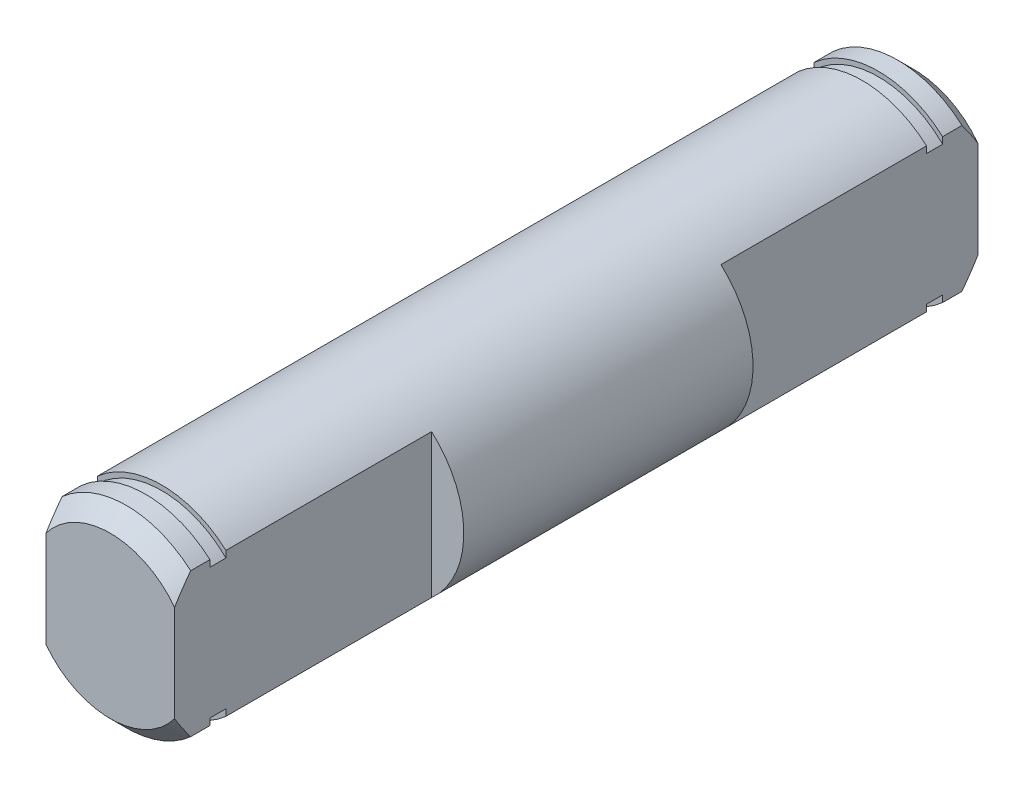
ISO-10303-21;
HEADER;
FILE_DESCRIPTION(('STEP AP214'),'2;1');
FILE_NAME('part.step','',(''),(''),'','','');
FILE_SCHEMA(('AUTOMOTIVE_DESIGN { 1 0 10303 214 1 1 1 1 }'));
ENDSEC;
DATA;
#1=APPLICATION_CONTEXT('core data for automotive mechanical design processes');
#2=APPLICATION_PROTOCOL_DEFINITION('international standard','automotive_design',2000,#1);
#3=PRODUCT_CONTEXT('',#1,'mechanical');
#4=PRODUCT('Part','Part','',(#3));
#5=PRODUCT_RELATED_PRODUCT_CATEGORY('part','',(#4));
#6=PRODUCT_DEFINITION_FORMATION('','',#4);
#7=PRODUCT_DEFINITION_CONTEXT('part definition',#1,'design');
#8=PRODUCT_DEFINITION('design','',#6,#7);
#9=PRODUCT_DEFINITION_SHAPE('','',#8);
#10=(LENGTH_UNIT() NAMED_UNIT(*) SI_UNIT(.MILLI.,.METRE.));
#11=(NAMED_UNIT(*) PLANE_ANGLE_UNIT() SI_UNIT($,.RADIAN.));
#12=(NAMED_UNIT(*) SI_UNIT($,.STERADIAN.) SOLID_ANGLE_UNIT());
#13=UNCERTAINTY_MEASURE_WITH_UNIT(LENGTH_MEASURE(1.E-05),#10,'distance_accuracy_value','');
#14=(GEOMETRIC_REPRESENTATION_CONTEXT(3) GLOBAL_UNCERTAINTY_ASSIGNED_CONTEXT((#13)) GLOBAL_UNIT_ASSIGNED_CONTEXT((#10,
#11,#12)) REPRESENTATION_CONTEXT('',''));
#15=CARTESIAN_POINT('',(0.,0.,0.));
#16=DIRECTION('',(0.,0.,1.));
#17=DIRECTION('',(1.,0.,0.));
#18=AXIS2_PLACEMENT_3D('',#15,#16,#17);
#19=CARTESIAN_POINT('',(0.,0.,12.5));
#20=DIRECTION('',(0.,0.,-1.));
#21=DIRECTION('',(-1.,0.,0.));
#22=AXIS2_PLACEMENT_3D('',#19,#20,#21);
#23=CYLINDRICAL_SURFACE('',#22,3.);
#24=DIRECTION('',(0.,0.,-1.));
#25=VECTOR('',#24,1.);
#26=CARTESIAN_POINT('',(-2.,2.23606797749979,12.5));
#27=LINE('',#26,#25);
#28=CARTESIAN_POINT('',(-2.,2.23606797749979,12.));
#29=VERTEX_POINT('',#28);
#30=CARTESIAN_POINT('',(-2.,2.23606797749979,11.4));
#31=VERTEX_POINT('',#30);
#32=EDGE_CURVE('E424',#29,#31,#27,.T.);
#33=ORIENTED_EDGE('',*,*,#32,.F.);
#34=CARTESIAN_POINT('',(0.,0.,12.));
#35=DIRECTION('',(0.,0.,1.));
#36=DIRECTION('',(1.,0.,0.));
#37=AXIS2_PLACEMENT_3D('',#34,#35,#36);
#38=CIRCLE('',#37,3.);
#39=CARTESIAN_POINT('',(2.,2.23606797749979,12.));
#40=VERTEX_POINT('',#39);
#41=EDGE_CURVE('E438',#29,#40,#38,.F.);
#42=ORIENTED_EDGE('',*,*,#41,.T.);
#43=DIRECTION('',(0.,0.,-1.));
#44=VECTOR('',#43,1.);
#45=CARTESIAN_POINT('',(2.,2.23606797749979,12.5));
#46=LINE('',#45,#44);
#47=CARTESIAN_POINT('',(2.,2.23606797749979,11.4));
#48=VERTEX_POINT('',#47);
#49=EDGE_CURVE('E383',#48,#40,#46,.F.);
#50=ORIENTED_EDGE('',*,*,#49,.F.);
#51=CARTESIAN_POINT('',(0.,0.,11.4));
#52=DIRECTION('',(0.,0.,-1.));
#53=DIRECTION('',(-1.,0.,0.));
#54=AXIS2_PLACEMENT_3D('',#51,#52,#53);
#55=CIRCLE('',#54,3.);
#56=EDGE_CURVE('E447',#31,#48,#55,.T.);
#57=ORIENTED_EDGE('',*,*,#56,.F.);
#58=EDGE_LOOP('',(#33,#42,#50,#57));
#59=FACE_BOUND('',#58,.T.);
#60=ADVANCED_FACE('F33',(#59),#23,.T.);
#61=DIRECTION('',(0.,0.,-1.));
#62=VECTOR('',#61,1.);
#63=CARTESIAN_POINT('',(-2.,-2.23606797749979,12.5));
#64=LINE('',#63,#62);
#65=CARTESIAN_POINT('',(-2.,-2.23606797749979,11.4));
#66=VERTEX_POINT('',#65);
#67=CARTESIAN_POINT('',(-2.,-2.23606797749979,12.));
#68=VERTEX_POINT('',#67);
#69=EDGE_CURVE('E417',#66,#68,#64,.F.);
#70=ORIENTED_EDGE('',*,*,#69,.F.);
#71=CARTESIAN_POINT('',(2.,-2.23606797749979,11.4));
#72=VERTEX_POINT('',#71);
#73=EDGE_CURVE('E446',#72,#66,#55,.T.);
#74=ORIENTED_EDGE('',*,*,#73,.F.);
#75=DIRECTION('',(0.,0.,-1.));
#76=VECTOR('',#75,1.);
#77=CARTESIAN_POINT('',(2.,-2.23606797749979,12.5));
#78=LINE('',#77,#76);
#79=CARTESIAN_POINT('',(2.,-2.23606797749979,12.));
#80=VERTEX_POINT('',#79);
#81=EDGE_CURVE('E474',#80,#72,#78,.T.);
#82=ORIENTED_EDGE('',*,*,#81,.F.);
#83=EDGE_CURVE('E440',#80,#68,#38,.F.);
#84=ORIENTED_EDGE('',*,*,#83,.T.);
#85=EDGE_LOOP('',(#70,#74,#82,#84));
#86=FACE_BOUND('',#85,.T.);
#87=ADVANCED_FACE('F321',(#86),#23,.T.);
#88=CARTESIAN_POINT('',(0.,0.,12.5));
#89=DIRECTION('',(0.,0.,1.));
#90=DIRECTION('',(1.,0.,0.));
#91=AXIS2_PLACEMENT_3D('',#88,#89,#90);
#92=PLANE('',#91);
#93=CARTESIAN_POINT('',(0.,0.,12.5));
#94=DIRECTION('',(0.,0.,1.));
#95=DIRECTION('',(1.,0.,0.));
#96=AXIS2_PLACEMENT_3D('',#93,#94,#95);
#97=CIRCLE('',#96,2.5);
#98=CARTESIAN_POINT('',(2.,1.5,12.5));
#99=VERTEX_POINT('',#98);
#100=CARTESIAN_POINT('',(-2.,1.5,12.5));
#101=VERTEX_POINT('',#100);
#102=EDGE_CURVE('E435',#99,#101,#97,.T.);
#103=ORIENTED_EDGE('',*,*,#102,.T.);
#104=DIRECTION('',(0.,-1.,0.));
#105=VECTOR('',#104,1.);
#106=CARTESIAN_POINT('',(-2.,3.30005546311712,12.5));
#107=LINE('',#106,#105);
#108=CARTESIAN_POINT('',(-2.,-1.5,12.5));
#109=VERTEX_POINT('',#108);
#110=EDGE_CURVE('E358',#101,#109,#107,.T.);
#111=ORIENTED_EDGE('',*,*,#110,.T.);
#112=CARTESIAN_POINT('',(2.,-1.5,12.5));
#113=VERTEX_POINT('',#112);
#114=EDGE_CURVE('E439',#109,#113,#97,.T.);
#115=ORIENTED_EDGE('',*,*,#114,.T.);
#116=DIRECTION('',(0.,1.,0.));
#117=VECTOR('',#116,1.);
#118=CARTESIAN_POINT('',(2.,3.30005546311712,12.5));
#119=LINE('',#118,#117);
#120=EDGE_CURVE('E361',#113,#99,#119,.T.);
#121=ORIENTED_EDGE('',*,*,#120,.T.);
#122=EDGE_LOOP('',(#103,#111,#115,#121));
#123=FACE_BOUND('',#122,.T.);
#124=ADVANCED_FACE('F327',(#123),#92,.T.);
#125=CARTESIAN_POINT('',(0.,0.,12.5));
#126=DIRECTION('',(0.,0.,-1.));
#127=DIRECTION('',(-1.,0.,0.));
#128=AXIS2_PLACEMENT_3D('',#125,#126,#127);
#129=CONICAL_SURFACE('',#128,2.5,0.785398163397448);
#130=ORIENTED_EDGE('',*,*,#41,.F.);
#131=CARTESIAN_POINT('',(-2.,6.3029766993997,8.38732162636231));
#132=CARTESIAN_POINT('',(-2.,6.1916153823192,8.49346541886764));
#133=CARTESIAN_POINT('',(-2.,6.08012784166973,8.59947668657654));
#134=CARTESIAN_POINT('',(-2.,5.85685182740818,8.81118323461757));
#135=CARTESIAN_POINT('',(-2.,5.74506335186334,8.916878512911));
#136=CARTESIAN_POINT('',(-2.,5.4091037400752,9.23347995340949));
#137=CARTESIAN_POINT('',(-2.,5.18441017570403,9.44383320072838));
#138=CARTESIAN_POINT('',(-2.,4.73080338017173,9.86451309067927));
#139=CARTESIAN_POINT('',(-2.,4.50187041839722,10.0748184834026));
#140=CARTESIAN_POINT('',(-2.,4.04109600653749,10.4921398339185));
#141=CARTESIAN_POINT('',(-2.,3.80925519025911,10.6991564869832));
#142=CARTESIAN_POINT('',(-2.,3.41557477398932,11.0427094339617));
#143=CARTESIAN_POINT('',(-2.,3.25498354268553,11.1806734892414));
#144=CARTESIAN_POINT('',(-2.,2.93065759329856,11.4530414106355));
#145=CARTESIAN_POINT('',(-2.,2.76692149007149,11.5874436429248));
#146=CARTESIAN_POINT('',(-2.,2.51812669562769,11.7846540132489));
#147=CARTESIAN_POINT('',(-2.,2.43475662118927,11.849589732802));
#148=CARTESIAN_POINT('',(-2.,2.26663374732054,11.9776417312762));
#149=CARTESIAN_POINT('',(-2.,2.18188103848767,12.0407581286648));
#150=CARTESIAN_POINT('',(-2.,2.01072574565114,12.1645933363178));
#151=CARTESIAN_POINT('',(-2.,1.92432436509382,12.2253138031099));
#152=CARTESIAN_POINT('',(-2.,1.74941695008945,12.3436296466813));
#153=CARTESIAN_POINT('',(-2.,1.66091137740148,12.4012257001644));
#154=CARTESIAN_POINT('',(-2.,1.50227028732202,12.4992212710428));
#155=CARTESIAN_POINT('',(-2.,1.43267637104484,12.5404935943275));
#156=CARTESIAN_POINT('',(-2.,1.29167710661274,12.6198677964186));
#157=CARTESIAN_POINT('',(-2.,1.22027148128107,12.6579691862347));
#158=CARTESIAN_POINT('',(-2.,1.07546452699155,12.7300460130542));
#159=CARTESIAN_POINT('',(-2.,1.00206522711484,12.7640254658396));
#160=CARTESIAN_POINT('',(-2.,0.853081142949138,12.8267151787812));
#161=CARTESIAN_POINT('',(-2.,0.777497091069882,12.8554271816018));
#162=CARTESIAN_POINT('',(-2.,0.58440339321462,12.9192396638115));
#163=CARTESIAN_POINT('',(-2.,0.465352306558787,12.9500128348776));
#164=CARTESIAN_POINT('',(-2.,0.284397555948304,12.9807588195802));
#165=CARTESIAN_POINT('',(-2.,0.22376384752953,12.988438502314));
#166=CARTESIAN_POINT('',(-2.,0.102037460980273,12.9983151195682));
#167=CARTESIAN_POINT('',(-2.,0.0409448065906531,13.0005123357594));
#168=CARTESIAN_POINT('',(-2.,-0.0813412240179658,12.9992836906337));
#169=CARTESIAN_POINT('',(-2.,-0.142534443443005,12.9958430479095));
#170=CARTESIAN_POINT('',(-2.,-0.264365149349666,12.9835143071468));
#171=CARTESIAN_POINT('',(-2.,-0.325002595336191,12.9746258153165));
#172=CARTESIAN_POINT('',(-2.,-0.445513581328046,12.9518382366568));
#173=CARTESIAN_POINT('',(-2.,-0.50538410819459,12.937923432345));
#174=CARTESIAN_POINT('',(-2.,-0.623920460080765,12.9057165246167));
#175=CARTESIAN_POINT('',(-2.,-0.682586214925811,12.8874241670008));
#176=CARTESIAN_POINT('',(-2.,-0.870096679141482,12.8223195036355));
#177=CARTESIAN_POINT('',(-2.,-0.996380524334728,12.7681300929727));
#178=CARTESIAN_POINT('',(-2.,-1.24305957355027,12.6476478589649));
#179=CARTESIAN_POINT('',(-2.,-1.36344236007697,12.5813307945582));
#180=CARTESIAN_POINT('',(-2.,-1.60114682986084,12.4398352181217));
#181=CARTESIAN_POINT('',(-2.,-1.71840078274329,12.3645442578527));
#182=CARTESIAN_POINT('',(-2.,-1.89143789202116,12.2475913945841));
#183=CARTESIAN_POINT('',(-2.,-1.94861845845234,12.2079559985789));
#184=CARTESIAN_POINT('',(-2.,-2.06217670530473,12.1275512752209));
#185=CARTESIAN_POINT('',(-2.,-2.11855440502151,12.0867819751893));
#186=CARTESIAN_POINT('',(-2.,-2.27151937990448,11.974196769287));
#187=CARTESIAN_POINT('',(-2.,-2.36741546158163,11.9014431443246));
#188=CARTESIAN_POINT('',(-2.,-2.5575773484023,11.7538303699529));
#189=CARTESIAN_POINT('',(-2.,-2.65184301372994,11.6789710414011));
#190=CARTESIAN_POINT('',(-2.,-2.83909574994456,11.5276197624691));
#191=CARTESIAN_POINT('',(-2.,-2.93208245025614,11.4511273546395));
#192=CARTESIAN_POINT('',(-2.,-3.11700238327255,11.2968779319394));
#193=CARTESIAN_POINT('',(-2.,-3.20893558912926,11.2191208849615));
#194=CARTESIAN_POINT('',(-2.,-3.48375900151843,10.9840952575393));
#195=CARTESIAN_POINT('',(-2.,-3.66536407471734,10.8253249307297));
#196=CARTESIAN_POINT('',(-2.,-4.02619748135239,10.5051814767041));
#197=CARTESIAN_POINT('',(-2.,-4.20542620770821,10.3438087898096));
#198=CARTESIAN_POINT('',(-2.,-4.54602117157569,10.033936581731));
#199=CARTESIAN_POINT('',(-2.,-4.70753312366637,9.88559698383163));
#200=CARTESIAN_POINT('',(-2.,-5.02950930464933,9.58777035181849));
#201=CARTESIAN_POINT('',(-2.,-5.18997348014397,9.43828326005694));
#202=CARTESIAN_POINT('',(-2.,-5.50956314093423,9.13892881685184));
#203=CARTESIAN_POINT('',(-2.,-5.66869128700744,8.98906430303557));
#204=CARTESIAN_POINT('',(-2.,-5.98628664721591,8.68865869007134));
#205=CARTESIAN_POINT('',(-2.,-6.14475390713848,8.53811763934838));
#206=CARTESIAN_POINT('',(-2.,-6.3029766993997,8.38732162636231));
#207=B_SPLINE_CURVE_WITH_KNOTS('',3,(#131,#132,#133,#134,#135,#136,#137,#138,#139,#140,#141,
#142,#143,#144,#145,#146,#147,#148,#149,#150,#151,#152,#153,#154,#155,#156,#157,#158,#159,#160,
#161,#162,#163,#164,#165,#166,#167,#168,#169,#170,#171,#172,#173,#174,#175,#176,#177,#178,#179,
#180,#181,#182,#183,#184,#185,#186,#187,#188,#189,#190,#191,#192,#193,#194,#195,#196,#197,#198,
#199,#200,#201,#202,#203,#204,#205,#206),.UNSPECIFIED.,.F.,.F.,(4,2,2,2,2,2,2,2,2,2,2,2,2,2,2,2,
2,2,2,2,2,2,2,2,2,2,2,2,2,2,2,2,2,2,2,2,2,4),(0.,0.461530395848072,0.923063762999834,
1.8464281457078,2.77901494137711,3.71140188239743,4.34652018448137,4.98192494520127,
5.29893184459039,5.6159180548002,5.9326811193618,6.24937530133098,6.49204579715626,
6.73475364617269,6.97722310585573,7.21961220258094,7.58685502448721,7.76999772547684,
7.95313101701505,8.13674521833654,8.32037269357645,8.50457942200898,8.68879684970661,
9.0999132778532,9.51186062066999,9.92965689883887,10.1383717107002,10.3470814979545,
10.7081519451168,11.0692532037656,11.4304569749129,11.7916699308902,12.5152929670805,
13.2387948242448,13.8966755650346,14.5545895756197,15.2103542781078,15.8660727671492),.UNSPECIFIED.);
#208=EDGE_CURVE('E418',#29,#101,#207,.T.);
#209=ORIENTED_EDGE('',*,*,#208,.T.);
#210=ORIENTED_EDGE('',*,*,#102,.F.);
#211=CARTESIAN_POINT('',(2.,-6.3029766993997,8.38732162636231));
#212=CARTESIAN_POINT('',(2.,-6.1916153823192,8.49346541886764));
#213=CARTESIAN_POINT('',(2.,-6.08012784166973,8.59947668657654));
#214=CARTESIAN_POINT('',(2.,-5.85685182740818,8.81118323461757));
#215=CARTESIAN_POINT('',(2.,-5.74506335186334,8.916878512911));
#216=CARTESIAN_POINT('',(2.,-5.4091037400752,9.23347995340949));
#217=CARTESIAN_POINT('',(2.,-5.18441017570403,9.44383320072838));
#218=CARTESIAN_POINT('',(2.,-4.73080338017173,9.86451309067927));
#219=CARTESIAN_POINT('',(2.,-4.50187041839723,10.0748184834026));
#220=CARTESIAN_POINT('',(2.,-4.04109600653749,10.4921398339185));
#221=CARTESIAN_POINT('',(2.,-3.80925519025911,10.6991564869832));
#222=CARTESIAN_POINT('',(2.,-3.41557477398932,11.0427094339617));
#223=CARTESIAN_POINT('',(2.,-3.25498354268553,11.1806734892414));
#224=CARTESIAN_POINT('',(2.,-2.93065759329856,11.4530414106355));
#225=CARTESIAN_POINT('',(2.,-2.76692149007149,11.5874436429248));
#226=CARTESIAN_POINT('',(2.,-2.51812669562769,11.7846540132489));
#227=CARTESIAN_POINT('',(2.,-2.43475662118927,11.849589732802));
#228=CARTESIAN_POINT('',(2.,-2.26663374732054,11.9776417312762));
#229=CARTESIAN_POINT('',(2.,-2.18188103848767,12.0407581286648));
#230=CARTESIAN_POINT('',(2.,-2.01072574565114,12.1645933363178));
#231=CARTESIAN_POINT('',(2.,-1.92432436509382,12.2253138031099));
#232=CARTESIAN_POINT('',(2.,-1.74941695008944,12.3436296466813));
#233=CARTESIAN_POINT('',(2.,-1.66091137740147,12.4012257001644));
#234=CARTESIAN_POINT('',(2.,-1.50227028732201,12.4992212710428));
#235=CARTESIAN_POINT('',(2.,-1.43267637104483,12.5404935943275));
#236=CARTESIAN_POINT('',(2.,-1.29167710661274,12.6198677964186));
#237=CARTESIAN_POINT('',(2.,-1.22027148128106,12.6579691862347));
#238=CARTESIAN_POINT('',(2.,-1.07546452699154,12.7300460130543));
#239=CARTESIAN_POINT('',(2.,-1.00206522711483,12.7640254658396));
#240=CARTESIAN_POINT('',(2.,-0.853081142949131,12.8267151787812));
#241=CARTESIAN_POINT('',(2.,-0.777497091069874,12.8554271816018));
#242=CARTESIAN_POINT('',(2.,-0.584403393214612,12.9192396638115));
#243=CARTESIAN_POINT('',(2.,-0.46535230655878,12.9500128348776));
#244=CARTESIAN_POINT('',(2.,-0.284397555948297,12.9807588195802));
#245=CARTESIAN_POINT('',(2.,-0.223763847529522,12.988438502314));
#246=CARTESIAN_POINT('',(2.,-0.102037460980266,12.9983151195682));
#247=CARTESIAN_POINT('',(2.,-0.0409448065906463,13.0005123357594));
#248=CARTESIAN_POINT('',(2.,0.0813412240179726,12.9992836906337));
#249=CARTESIAN_POINT('',(2.,0.142534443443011,12.9958430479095));
#250=CARTESIAN_POINT('',(2.,0.264365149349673,12.9835143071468));
#251=CARTESIAN_POINT('',(2.,0.325002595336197,12.9746258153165));
#252=CARTESIAN_POINT('',(2.,0.445513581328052,12.9518382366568));
#253=CARTESIAN_POINT('',(2.,0.505384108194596,12.937923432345));
#254=CARTESIAN_POINT('',(2.,0.623920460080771,12.9057165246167));
#255=CARTESIAN_POINT('',(2.,0.682586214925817,12.8874241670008));
#256=CARTESIAN_POINT('',(2.,0.870096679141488,12.8223195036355));
#257=CARTESIAN_POINT('',(2.,0.996380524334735,12.7681300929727));
#258=CARTESIAN_POINT('',(2.,1.24305957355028,12.6476478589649));
#259=CARTESIAN_POINT('',(2.,1.36344236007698,12.5813307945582));
#260=CARTESIAN_POINT('',(2.,1.60114682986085,12.4398352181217));
#261=CARTESIAN_POINT('',(2.,1.7184007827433,12.3645442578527));
#262=CARTESIAN_POINT('',(2.,1.89143789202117,12.2475913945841));
#263=CARTESIAN_POINT('',(2.,1.94861845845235,12.2079559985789));
#264=CARTESIAN_POINT('',(2.,2.06217670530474,12.1275512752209));
#265=CARTESIAN_POINT('',(2.,2.11855440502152,12.0867819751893));
#266=CARTESIAN_POINT('',(2.,2.27151937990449,11.974196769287));
#267=CARTESIAN_POINT('',(2.,2.36741546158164,11.9014431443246));
#268=CARTESIAN_POINT('',(2.,2.55757734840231,11.7538303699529));
#269=CARTESIAN_POINT('',(2.,2.65184301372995,11.6789710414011));
#270=CARTESIAN_POINT('',(2.,2.83909574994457,11.5276197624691));
#271=CARTESIAN_POINT('',(2.,2.93208245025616,11.4511273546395));
#272=CARTESIAN_POINT('',(2.,3.11700238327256,11.2968779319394));
#273=CARTESIAN_POINT('',(2.,3.20893558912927,11.2191208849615));
#274=CARTESIAN_POINT('',(2.,3.48375900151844,10.9840952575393));
#275=CARTESIAN_POINT('',(2.,3.66536407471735,10.8253249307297));
#276=CARTESIAN_POINT('',(2.,4.0261974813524,10.5051814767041));
#277=CARTESIAN_POINT('',(2.,4.20542620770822,10.3438087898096));
#278=CARTESIAN_POINT('',(2.,4.5460211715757,10.033936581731));
#279=CARTESIAN_POINT('',(2.,4.70753312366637,9.88559698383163));
#280=CARTESIAN_POINT('',(2.,5.02950930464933,9.58777035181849));
#281=CARTESIAN_POINT('',(2.,5.18997348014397,9.43828326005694));
#282=CARTESIAN_POINT('',(2.,5.50956314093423,9.13892881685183));
#283=CARTESIAN_POINT('',(2.,5.66869128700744,8.98906430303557));
#284=CARTESIAN_POINT('',(2.,5.98628664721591,8.68865869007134));
#285=CARTESIAN_POINT('',(2.,6.14475390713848,8.53811763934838));
#286=CARTESIAN_POINT('',(2.,6.3029766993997,8.38732162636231));
#287=B_SPLINE_CURVE_WITH_KNOTS('',3,(#211,#212,#213,#214,#215,#216,#217,#218,#219,#220,#221,
#222,#223,#224,#225,#226,#227,#228,#229,#230,#231,#232,#233,#234,#235,#236,#237,#238,#239,#240,
#241,#242,#243,#244,#245,#246,#247,#248,#249,#250,#251,#252,#253,#254,#255,#256,#257,#258,#259,
#260,#261,#262,#263,#264,#265,#266,#267,#268,#269,#270,#271,#272,#273,#274,#275,#276,#277,#278,
#279,#280,#281,#282,#283,#284,#285,#286),.UNSPECIFIED.,.F.,.F.,(4,2,2,2,2,2,2,2,2,2,2,2,2,2,2,2,
2,2,2,2,2,2,2,2,2,2,2,2,2,2,2,2,2,2,2,2,2,4),(0.,0.461530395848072,0.923063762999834,
1.84642814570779,2.77901494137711,3.71140188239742,4.34652018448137,4.98192494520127,
5.29893184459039,5.6159180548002,5.9326811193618,6.24937530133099,6.49204579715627,
6.7347536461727,6.97722310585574,7.21961220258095,7.58685502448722,7.76999772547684,
7.95313101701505,8.13674521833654,8.32037269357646,8.50457942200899,8.68879684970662,
9.09991327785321,9.51186062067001,9.92965689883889,10.1383717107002,10.3470814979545,
10.7081519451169,11.0692532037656,11.430456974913,11.7916699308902,12.5152929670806,
13.2387948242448,13.8966755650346,14.5545895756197,15.2103542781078,15.8660727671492),.UNSPECIFIED.);
#288=EDGE_CURVE('E386',#99,#40,#287,.T.);
#289=ORIENTED_EDGE('',*,*,#288,.T.);
#290=EDGE_LOOP('',(#130,#209,#210,#289));
#291=FACE_BOUND('',#290,.T.);
#292=ADVANCED_FACE('F396',(#291),#129,.T.);
#293=ORIENTED_EDGE('',*,*,#114,.F.);
#294=EDGE_CURVE('E409',#109,#68,#207,.T.);
#295=ORIENTED_EDGE('',*,*,#294,.T.);
#296=ORIENTED_EDGE('',*,*,#83,.F.);
#297=EDGE_CURVE('E393',#80,#113,#287,.T.);
#298=ORIENTED_EDGE('',*,*,#297,.T.);
#299=EDGE_LOOP('',(#293,#295,#296,#298));
#300=FACE_BOUND('',#299,.T.);
#301=ADVANCED_FACE('F497',(#300),#129,.T.);
#302=CARTESIAN_POINT('',(3.65132187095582,0.,11.4));
#303=DIRECTION('',(0.,0.,-1.));
#304=DIRECTION('',(-1.,0.,0.));
#305=AXIS2_PLACEMENT_3D('',#302,#303,#304);
#306=PLANE('',#305);
#307=ORIENTED_EDGE('',*,*,#73,.T.);
#308=DIRECTION('',(0.,1.,0.));
#309=VECTOR('',#308,1.);
#310=CARTESIAN_POINT('',(-2.,0.,11.4));
#311=LINE('',#310,#309);
#312=CARTESIAN_POINT('',(-2.,-2.0303940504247,11.4));
#313=VERTEX_POINT('',#312);
#314=EDGE_CURVE('E471',#66,#313,#311,.T.);
#315=ORIENTED_EDGE('',*,*,#314,.T.);
#316=CARTESIAN_POINT('',(0.,0.,11.4));
#317=DIRECTION('',(0.,0.,-1.));
#318=DIRECTION('',(-1.,0.,0.));
#319=AXIS2_PLACEMENT_3D('',#316,#317,#318);
#320=CIRCLE('',#319,2.85);
#321=CARTESIAN_POINT('',(2.,-2.0303940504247,11.4));
#322=VERTEX_POINT('',#321);
#323=EDGE_CURVE('E429',#322,#313,#320,.T.);
#324=ORIENTED_EDGE('',*,*,#323,.F.);
#325=DIRECTION('',(0.,-1.,0.));
#326=VECTOR('',#325,1.);
#327=CARTESIAN_POINT('',(2.,0.,11.4));
#328=LINE('',#327,#326);
#329=EDGE_CURVE('E384',#322,#72,#328,.T.);
#330=ORIENTED_EDGE('',*,*,#329,.T.);
#331=EDGE_LOOP('',(#307,#315,#324,#330));
#332=FACE_BOUND('',#331,.T.);
#333=ADVANCED_FACE('F507',(#332),#306,.T.);
#334=CARTESIAN_POINT('',(-2.,2.0303940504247,11.4));
#335=VERTEX_POINT('',#334);
#336=CARTESIAN_POINT('',(2.,2.0303940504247,11.4));
#337=VERTEX_POINT('',#336);
#338=EDGE_CURVE('E431',#335,#337,#320,.T.);
#339=ORIENTED_EDGE('',*,*,#338,.F.);
#340=EDGE_CURVE('E423',#335,#31,#311,.T.);
#341=ORIENTED_EDGE('',*,*,#340,.T.);
#342=ORIENTED_EDGE('',*,*,#56,.T.);
#343=EDGE_CURVE('E380',#48,#337,#328,.T.);
#344=ORIENTED_EDGE('',*,*,#343,.T.);
#345=EDGE_LOOP('',(#339,#341,#342,#344));
#346=FACE_BOUND('',#345,.T.);
#347=ADVANCED_FACE('F483',(#346),#306,.T.);
#348=CARTESIAN_POINT('',(3.65132187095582,0.,10.9));
#349=DIRECTION('',(0.,0.,1.));
#350=DIRECTION('',(1.,0.,0.));
#351=AXIS2_PLACEMENT_3D('',#348,#349,#350);
#352=PLANE('',#351);
#353=CARTESIAN_POINT('',(0.,0.,10.9));
#354=DIRECTION('',(0.,0.,1.));
#355=DIRECTION('',(1.,0.,0.));
#356=AXIS2_PLACEMENT_3D('',#353,#354,#355);
#357=CIRCLE('',#356,3.);
#358=CARTESIAN_POINT('',(2.,2.23606797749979,10.9));
#359=VERTEX_POINT('',#358);
#360=CARTESIAN_POINT('',(-2.,2.23606797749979,10.9));
#361=VERTEX_POINT('',#360);
#362=EDGE_CURVE('E444',#359,#361,#357,.T.);
#363=ORIENTED_EDGE('',*,*,#362,.T.);
#364=DIRECTION('',(0.,-1.,0.));
#365=VECTOR('',#364,1.);
#366=CARTESIAN_POINT('',(-2.,0.,10.9));
#367=LINE('',#366,#365);
#368=CARTESIAN_POINT('',(-2.,2.0303940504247,10.9));
#369=VERTEX_POINT('',#368);
#370=EDGE_CURVE('E416',#361,#369,#367,.T.);
#371=ORIENTED_EDGE('',*,*,#370,.T.);
#372=CARTESIAN_POINT('',(0.,0.,10.9));
#373=DIRECTION('',(0.,0.,-1.));
#374=DIRECTION('',(-1.,0.,0.));
#375=AXIS2_PLACEMENT_3D('',#372,#373,#374);
#376=CIRCLE('',#375,2.85);
#377=CARTESIAN_POINT('',(2.,2.0303940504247,10.9));
#378=VERTEX_POINT('',#377);
#379=EDGE_CURVE('E426',#369,#378,#376,.T.);
#380=ORIENTED_EDGE('',*,*,#379,.T.);
#381=DIRECTION('',(0.,1.,0.));
#382=VECTOR('',#381,1.);
#383=CARTESIAN_POINT('',(2.,0.,10.9));
#384=LINE('',#383,#382);
#385=EDGE_CURVE('E373',#378,#359,#384,.T.);
#386=ORIENTED_EDGE('',*,*,#385,.T.);
#387=EDGE_LOOP('',(#363,#371,#380,#386));
#388=FACE_BOUND('',#387,.T.);
#389=ADVANCED_FACE('F478',(#388),#352,.T.);
#390=CARTESIAN_POINT('',(2.,-2.0303940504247,10.9));
#391=VERTEX_POINT('',#390);
#392=CARTESIAN_POINT('',(-2.,-2.0303940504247,10.9));
#393=VERTEX_POINT('',#392);
#394=EDGE_CURVE('E430',#391,#393,#376,.T.);
#395=ORIENTED_EDGE('',*,*,#394,.T.);
#396=CARTESIAN_POINT('',(-2.,-2.23606797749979,10.9));
#397=VERTEX_POINT('',#396);
#398=EDGE_CURVE('E467',#393,#397,#367,.T.);
#399=ORIENTED_EDGE('',*,*,#398,.T.);
#400=CARTESIAN_POINT('',(2.,-2.23606797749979,10.9));
#401=VERTEX_POINT('',#400);
#402=EDGE_CURVE('E434',#397,#401,#357,.T.);
#403=ORIENTED_EDGE('',*,*,#402,.T.);
#404=EDGE_CURVE('E377',#401,#391,#384,.T.);
#405=ORIENTED_EDGE('',*,*,#404,.T.);
#406=EDGE_LOOP('',(#395,#399,#403,#405));
#407=FACE_BOUND('',#406,.T.);
#408=ADVANCED_FACE('F465',(#407),#352,.T.);
#409=CARTESIAN_POINT('',(0.,0.,0.));
#410=DIRECTION('',(0.,0.,-1.));
#411=DIRECTION('',(-1.,0.,0.));
#412=AXIS2_PLACEMENT_3D('',#409,#410,#411);
#413=CYLINDRICAL_SURFACE('',#412,2.85);
#414=ORIENTED_EDGE('',*,*,#379,.F.);
#415=DIRECTION('',(0.,0.,-1.));
#416=VECTOR('',#415,1.);
#417=CARTESIAN_POINT('',(-2.,2.0303940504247,0.));
#418=LINE('',#417,#416);
#419=EDGE_CURVE('E420',#369,#335,#418,.F.);
#420=ORIENTED_EDGE('',*,*,#419,.T.);
#421=ORIENTED_EDGE('',*,*,#338,.T.);
#422=DIRECTION('',(0.,0.,-1.));
#423=VECTOR('',#422,1.);
#424=CARTESIAN_POINT('',(2.,2.0303940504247,0.));
#425=LINE('',#424,#423);
#426=EDGE_CURVE('E376',#337,#378,#425,.T.);
#427=ORIENTED_EDGE('',*,*,#426,.T.);
#428=EDGE_LOOP('',(#414,#420,#421,#427));
#429=FACE_BOUND('',#428,.T.);
#430=ADVANCED_FACE('F340',(#429),#413,.T.);
#431=ORIENTED_EDGE('',*,*,#323,.T.);
#432=DIRECTION('',(0.,0.,-1.));
#433=VECTOR('',#432,1.);
#434=CARTESIAN_POINT('',(-2.,-2.0303940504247,0.));
#435=LINE('',#434,#433);
#436=EDGE_CURVE('E469',#313,#393,#435,.T.);
#437=ORIENTED_EDGE('',*,*,#436,.T.);
#438=ORIENTED_EDGE('',*,*,#394,.F.);
#439=DIRECTION('',(0.,0.,-1.));
#440=VECTOR('',#439,1.);
#441=CARTESIAN_POINT('',(2.,-2.0303940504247,0.));
#442=LINE('',#441,#440);
#443=EDGE_CURVE('E394',#391,#322,#442,.F.);
#444=ORIENTED_EDGE('',*,*,#443,.T.);
#445=EDGE_LOOP('',(#431,#437,#438,#444));
#446=FACE_BOUND('',#445,.T.);
#447=ADVANCED_FACE('F332',(#446),#413,.T.);
#448=DIRECTION('',(0.,0.,-1.));
#449=VECTOR('',#448,1.);
#450=CARTESIAN_POINT('',(-2.,2.23606797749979,12.5));
#451=LINE('',#450,#449);
#452=CARTESIAN_POINT('',(-2.,2.23606797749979,4.5));
#453=VERTEX_POINT('',#452);
#454=EDGE_CURVE('E12',#361,#453,#451,.T.);
#455=ORIENTED_EDGE('',*,*,#454,.F.);
#456=ORIENTED_EDGE('',*,*,#362,.F.);
#457=DIRECTION('',(0.,0.,-1.));
#458=VECTOR('',#457,1.);
#459=CARTESIAN_POINT('',(2.,2.23606797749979,12.5));
#460=LINE('',#459,#458);
#461=CARTESIAN_POINT('',(2.,2.23606797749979,4.5));
#462=VERTEX_POINT('',#461);
#463=EDGE_CURVE('E443',#462,#359,#460,.F.);
#464=ORIENTED_EDGE('',*,*,#463,.F.);
#465=CARTESIAN_POINT('',(0.,0.,4.5));
#466=DIRECTION('',(0.,0.,1.));
#467=DIRECTION('',(1.,0.,0.));
#468=AXIS2_PLACEMENT_3D('',#465,#466,#467);
#469=CIRCLE('',#468,3.);
#470=CARTESIAN_POINT('',(2.,-2.23606797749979,4.5));
#471=VERTEX_POINT('',#470);
#472=EDGE_CURVE('E451',#471,#462,#469,.T.);
#473=ORIENTED_EDGE('',*,*,#472,.F.);
#474=DIRECTION('',(0.,0.,-1.));
#475=VECTOR('',#474,1.);
#476=CARTESIAN_POINT('',(2.,-2.23606797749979,12.5));
#477=LINE('',#476,#475);
#478=EDGE_CURVE('E453',#401,#471,#477,.T.);
#479=ORIENTED_EDGE('',*,*,#478,.F.);
#480=ORIENTED_EDGE('',*,*,#402,.F.);
#481=DIRECTION('',(0.,0.,-1.));
#482=VECTOR('',#481,1.);
#483=CARTESIAN_POINT('',(-2.,-2.23606797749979,12.5));
#484=LINE('',#483,#482);
#485=CARTESIAN_POINT('',(-2.,-2.23606797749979,4.5));
#486=VERTEX_POINT('',#485);
#487=EDGE_CURVE('E454',#486,#397,#484,.F.);
#488=ORIENTED_EDGE('',*,*,#487,.F.);
#489=EDGE_CURVE('E40',#453,#486,#469,.T.);
#490=ORIENTED_EDGE('',*,*,#489,.F.);
#491=EDGE_LOOP('',(#455,#456,#464,#473,#479,#480,#488,#490));
#492=FACE_BOUND('',#491,.T.);
#493=DIRECTION('',(0.,0.,1.));
#494=VECTOR('',#493,1.);
#495=CARTESIAN_POINT('',(-2.,2.23606797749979,-12.5));
#496=LINE('',#495,#494);
#497=CARTESIAN_POINT('',(-2.,2.23606797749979,-10.9));
#498=VERTEX_POINT('',#497);
#499=CARTESIAN_POINT('',(-2.,2.23606797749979,-4.5));
#500=VERTEX_POINT('',#499);
#501=EDGE_CURVE('E351',#498,#500,#496,.T.);
#502=ORIENTED_EDGE('',*,*,#501,.T.);
#503=CARTESIAN_POINT('',(0.,0.,-4.5));
#504=DIRECTION('',(0.,0.,1.));
#505=DIRECTION('',(1.,0.,0.));
#506=AXIS2_PLACEMENT_3D('',#503,#504,#505);
#507=CIRCLE('',#506,3.);
#508=CARTESIAN_POINT('',(-2.,-2.23606797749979,-4.5));
#509=VERTEX_POINT('',#508);
#510=EDGE_CURVE('E353',#500,#509,#507,.T.);
#511=ORIENTED_EDGE('',*,*,#510,.T.);
#512=DIRECTION('',(0.,0.,1.));
#513=VECTOR('',#512,1.);
#514=CARTESIAN_POINT('',(-2.,-2.23606797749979,-12.5));
#515=LINE('',#514,#513);
#516=CARTESIAN_POINT('',(-2.,-2.23606797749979,-10.9));
#517=VERTEX_POINT('',#516);
#518=EDGE_CURVE('E363',#509,#517,#515,.F.);
#519=ORIENTED_EDGE('',*,*,#518,.T.);
#520=CARTESIAN_POINT('',(0.,0.,-10.9));
#521=DIRECTION('',(0.,0.,1.));
#522=DIRECTION('',(1.,0.,0.));
#523=AXIS2_PLACEMENT_3D('',#520,#521,#522);
#524=CIRCLE('',#523,3.);
#525=CARTESIAN_POINT('',(2.,-2.23606797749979,-10.9));
#526=VERTEX_POINT('',#525);
#527=EDGE_CURVE('E680',#517,#526,#524,.T.);
#528=ORIENTED_EDGE('',*,*,#527,.T.);
#529=DIRECTION('',(0.,0.,1.));
#530=VECTOR('',#529,1.);
#531=CARTESIAN_POINT('',(2.,-2.23606797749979,-12.5));
#532=LINE('',#531,#530);
#533=CARTESIAN_POINT('',(2.,-2.23606797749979,-4.5));
#534=VERTEX_POINT('',#533);
#535=EDGE_CURVE('E676',#526,#534,#532,.T.);
#536=ORIENTED_EDGE('',*,*,#535,.T.);
#537=CARTESIAN_POINT('',(2.,2.23606797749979,-4.5));
#538=VERTEX_POINT('',#537);
#539=EDGE_CURVE('E365',#534,#538,#507,.T.);
#540=ORIENTED_EDGE('',*,*,#539,.T.);
#541=DIRECTION('',(0.,0.,1.));
#542=VECTOR('',#541,1.);
#543=CARTESIAN_POINT('',(2.,2.23606797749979,-12.5));
#544=LINE('',#543,#542);
#545=CARTESIAN_POINT('',(2.,2.23606797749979,-10.9));
#546=VERTEX_POINT('',#545);
#547=EDGE_CURVE('E677',#538,#546,#544,.F.);
#548=ORIENTED_EDGE('',*,*,#547,.T.);
#549=EDGE_CURVE('E355',#546,#498,#524,.T.);
#550=ORIENTED_EDGE('',*,*,#549,.T.);
#551=EDGE_LOOP('',(#502,#511,#519,#528,#536,#540,#548,#550));
#552=FACE_BOUND('',#551,.T.);
#553=ADVANCED_FACE('F323',(#492,#552),#23,.T.);
#554=CARTESIAN_POINT('',(2.,3.30005546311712,4.5));
#555=DIRECTION('',(1.,0.,0.));
#556=DIRECTION('',(0.,1.,0.));
#557=AXIS2_PLACEMENT_3D('',#554,#555,#556);
#558=PLANE('',#557);
#559=ORIENTED_EDGE('',*,*,#81,.T.);
#560=ORIENTED_EDGE('',*,*,#329,.F.);
#561=ORIENTED_EDGE('',*,*,#443,.F.);
#562=ORIENTED_EDGE('',*,*,#404,.F.);
#563=ORIENTED_EDGE('',*,*,#478,.T.);
#564=DIRECTION('',(0.,1.,0.));
#565=VECTOR('',#564,1.);
#566=CARTESIAN_POINT('',(2.,3.30005546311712,4.5));
#567=LINE('',#566,#565);
#568=EDGE_CURVE('E54',#471,#462,#567,.T.);
#569=ORIENTED_EDGE('',*,*,#568,.T.);
#570=ORIENTED_EDGE('',*,*,#463,.T.);
#571=ORIENTED_EDGE('',*,*,#385,.F.);
#572=ORIENTED_EDGE('',*,*,#426,.F.);
#573=ORIENTED_EDGE('',*,*,#343,.F.);
#574=ORIENTED_EDGE('',*,*,#49,.T.);
#575=ORIENTED_EDGE('',*,*,#288,.F.);
#576=ORIENTED_EDGE('',*,*,#120,.F.);
#577=ORIENTED_EDGE('',*,*,#297,.F.);
#578=EDGE_LOOP('',(#559,#560,#561,#562,#563,#569,#570,#571,#572,#573,#574,#575,#576,#577));
#579=FACE_BOUND('',#578,.T.);
#580=ADVANCED_FACE('F331',(#579),#558,.T.);
#581=CARTESIAN_POINT('',(0.,0.0388241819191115,4.5));
#582=DIRECTION('',(0.,0.,1.));
#583=DIRECTION('',(1.,0.,0.));
#584=AXIS2_PLACEMENT_3D('',#581,#582,#583);
#585=PLANE('',#584);
#586=ORIENTED_EDGE('',*,*,#472,.T.);
#587=ORIENTED_EDGE('',*,*,#568,.F.);
#588=EDGE_LOOP('',(#586,#587));
#589=FACE_BOUND('',#588,.T.);
#590=ADVANCED_FACE('F338',(#589),#585,.T.);
#591=ORIENTED_EDGE('',*,*,#489,.T.);
#592=DIRECTION('',(0.,-1.,0.));
#593=VECTOR('',#592,1.);
#594=CARTESIAN_POINT('',(-2.,3.30005546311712,4.5));
#595=LINE('',#594,#593);
#596=EDGE_CURVE('E46',#453,#486,#595,.T.);
#597=ORIENTED_EDGE('',*,*,#596,.F.);
#598=EDGE_LOOP('',(#591,#597));
#599=FACE_BOUND('',#598,.T.);
#600=ADVANCED_FACE('F406',(#599),#585,.T.);
#601=CARTESIAN_POINT('',(-2.,3.30005546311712,4.5));
#602=DIRECTION('',(-1.,0.,0.));
#603=DIRECTION('',(0.,-1.,0.));
#604=AXIS2_PLACEMENT_3D('',#601,#602,#603);
#605=PLANE('',#604);
#606=ORIENTED_EDGE('',*,*,#32,.T.);
#607=ORIENTED_EDGE('',*,*,#340,.F.);
#608=ORIENTED_EDGE('',*,*,#419,.F.);
#609=ORIENTED_EDGE('',*,*,#370,.F.);
#610=ORIENTED_EDGE('',*,*,#454,.T.);
#611=ORIENTED_EDGE('',*,*,#596,.T.);
#612=ORIENTED_EDGE('',*,*,#487,.T.);
#613=ORIENTED_EDGE('',*,*,#398,.F.);
#614=ORIENTED_EDGE('',*,*,#436,.F.);
#615=ORIENTED_EDGE('',*,*,#314,.F.);
#616=ORIENTED_EDGE('',*,*,#69,.T.);
#617=ORIENTED_EDGE('',*,*,#294,.F.);
#618=ORIENTED_EDGE('',*,*,#110,.F.);
#619=ORIENTED_EDGE('',*,*,#208,.F.);
#620=EDGE_LOOP('',(#606,#607,#608,#609,#610,#611,#612,#613,#614,#615,#616,#617,#618,#619));
#621=FACE_BOUND('',#620,.T.);
#622=ADVANCED_FACE('F402',(#621),#605,.T.);
#623=CARTESIAN_POINT('',(0.,0.,-12.5));
#624=DIRECTION('',(0.,0.,1.));
#625=DIRECTION('',(-1.,0.,0.));
#626=AXIS2_PLACEMENT_3D('',#623,#624,#625);
#627=CYLINDRICAL_SURFACE('',#626,3.);
#628=DIRECTION('',(0.,0.,1.));
#629=VECTOR('',#628,1.);
#630=CARTESIAN_POINT('',(-2.,2.23606797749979,-12.5));
#631=LINE('',#630,#629);
#632=CARTESIAN_POINT('',(-2.,2.23606797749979,-12.));
#633=VERTEX_POINT('',#632);
#634=CARTESIAN_POINT('',(-2.,2.23606797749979,-11.4));
#635=VERTEX_POINT('',#634);
#636=EDGE_CURVE('E698',#633,#635,#631,.T.);
#637=ORIENTED_EDGE('',*,*,#636,.T.);
#638=CARTESIAN_POINT('',(0.,0.,-11.4));
#639=DIRECTION('',(0.,0.,-1.));
#640=DIRECTION('',(-1.,0.,0.));
#641=AXIS2_PLACEMENT_3D('',#638,#639,#640);
#642=CIRCLE('',#641,3.);
#643=CARTESIAN_POINT('',(2.,2.23606797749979,-11.4));
#644=VERTEX_POINT('',#643);
#645=EDGE_CURVE('E238',#635,#644,#642,.T.);
#646=ORIENTED_EDGE('',*,*,#645,.T.);
#647=DIRECTION('',(0.,0.,1.));
#648=VECTOR('',#647,1.);
#649=CARTESIAN_POINT('',(2.,2.23606797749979,-12.5));
#650=LINE('',#649,#648);
#651=CARTESIAN_POINT('',(2.,2.23606797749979,-12.));
#652=VERTEX_POINT('',#651);
#653=EDGE_CURVE('E259',#644,#652,#650,.F.);
#654=ORIENTED_EDGE('',*,*,#653,.T.);
#655=CARTESIAN_POINT('',(0.,0.,-12.));
#656=DIRECTION('',(0.,0.,1.));
#657=DIRECTION('',(1.,0.,0.));
#658=AXIS2_PLACEMENT_3D('',#655,#656,#657);
#659=CIRCLE('',#658,3.);
#660=EDGE_CURVE('E690',#633,#652,#659,.F.);
#661=ORIENTED_EDGE('',*,*,#660,.F.);
#662=EDGE_LOOP('',(#637,#646,#654,#661));
#663=FACE_BOUND('',#662,.T.);
#664=ADVANCED_FACE('F401',(#663),#627,.T.);
#665=DIRECTION('',(0.,0.,1.));
#666=VECTOR('',#665,1.);
#667=CARTESIAN_POINT('',(-2.,-2.23606797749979,-12.5));
#668=LINE('',#667,#666);
#669=CARTESIAN_POINT('',(-2.,-2.23606797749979,-11.4));
#670=VERTEX_POINT('',#669);
#671=CARTESIAN_POINT('',(-2.,-2.23606797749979,-12.));
#672=VERTEX_POINT('',#671);
#673=EDGE_CURVE('E289',#670,#672,#668,.F.);
#674=ORIENTED_EDGE('',*,*,#673,.T.);
#675=CARTESIAN_POINT('',(2.,-2.23606797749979,-12.));
#676=VERTEX_POINT('',#675);
#677=EDGE_CURVE('E685',#676,#672,#659,.F.);
#678=ORIENTED_EDGE('',*,*,#677,.F.);
#679=DIRECTION('',(0.,0.,1.));
#680=VECTOR('',#679,1.);
#681=CARTESIAN_POINT('',(2.,-2.23606797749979,-12.5));
#682=LINE('',#681,#680);
#683=CARTESIAN_POINT('',(2.,-2.23606797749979,-11.4));
#684=VERTEX_POINT('',#683);
#685=EDGE_CURVE('E223',#676,#684,#682,.T.);
#686=ORIENTED_EDGE('',*,*,#685,.T.);
#687=EDGE_CURVE('E688',#684,#670,#642,.T.);
#688=ORIENTED_EDGE('',*,*,#687,.T.);
#689=EDGE_LOOP('',(#674,#678,#686,#688));
#690=FACE_BOUND('',#689,.T.);
#691=ADVANCED_FACE('F584',(#690),#627,.T.);
#692=CARTESIAN_POINT('',(0.,0.,-12.5));
#693=DIRECTION('',(0.,0.,-1.));
#694=DIRECTION('',(1.,0.,0.));
#695=AXIS2_PLACEMENT_3D('',#692,#693,#694);
#696=PLANE('',#695);
#697=CARTESIAN_POINT('',(0.,0.,-12.5));
#698=DIRECTION('',(0.,0.,1.));
#699=DIRECTION('',(1.,0.,0.));
#700=AXIS2_PLACEMENT_3D('',#697,#698,#699);
#701=CIRCLE('',#700,2.5);
#702=CARTESIAN_POINT('',(2.,1.5,-12.5));
#703=VERTEX_POINT('',#702);
#704=CARTESIAN_POINT('',(-2.,1.5,-12.5));
#705=VERTEX_POINT('',#704);
#706=EDGE_CURVE('E237',#703,#705,#701,.T.);
#707=ORIENTED_EDGE('',*,*,#706,.F.);
#708=DIRECTION('',(0.,1.,0.));
#709=VECTOR('',#708,1.);
#710=CARTESIAN_POINT('',(2.,3.30005546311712,-12.5));
#711=LINE('',#710,#709);
#712=CARTESIAN_POINT('',(2.,-1.5,-12.5));
#713=VERTEX_POINT('',#712);
#714=EDGE_CURVE('E220',#713,#703,#711,.T.);
#715=ORIENTED_EDGE('',*,*,#714,.F.);
#716=CARTESIAN_POINT('',(-2.,-1.5,-12.5));
#717=VERTEX_POINT('',#716);
#718=EDGE_CURVE('E231',#717,#713,#701,.T.);
#719=ORIENTED_EDGE('',*,*,#718,.F.);
#720=DIRECTION('',(0.,-1.,0.));
#721=VECTOR('',#720,1.);
#722=CARTESIAN_POINT('',(-2.,3.30005546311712,-12.5));
#723=LINE('',#722,#721);
#724=EDGE_CURVE('E243',#705,#717,#723,.T.);
#725=ORIENTED_EDGE('',*,*,#724,.F.);
#726=EDGE_LOOP('',(#707,#715,#719,#725));
#727=FACE_BOUND('',#726,.T.);
#728=ADVANCED_FACE('F240',(#727),#696,.T.);
#729=CARTESIAN_POINT('',(0.,0.,-12.5));
#730=DIRECTION('',(0.,0.,1.));
#731=DIRECTION('',(-1.,0.,0.));
#732=AXIS2_PLACEMENT_3D('',#729,#730,#731);
#733=CONICAL_SURFACE('',#732,2.5,0.785398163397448);
#734=ORIENTED_EDGE('',*,*,#660,.T.);
#735=CARTESIAN_POINT('',(2.,-6.3029766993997,-8.38732162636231));
#736=CARTESIAN_POINT('',(2.,-6.1916153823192,-8.49346541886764));
#737=CARTESIAN_POINT('',(2.,-6.08012784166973,-8.59947668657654));
#738=CARTESIAN_POINT('',(2.,-5.85685182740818,-8.81118323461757));
#739=CARTESIAN_POINT('',(2.,-5.74506335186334,-8.916878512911));
#740=CARTESIAN_POINT('',(2.,-5.4091037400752,-9.23347995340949));
#741=CARTESIAN_POINT('',(2.,-5.18441017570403,-9.44383320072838));
#742=CARTESIAN_POINT('',(2.,-4.73080338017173,-9.86451309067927));
#743=CARTESIAN_POINT('',(2.,-4.50187041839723,-10.0748184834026));
#744=CARTESIAN_POINT('',(2.,-4.04109600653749,-10.4921398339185));
#745=CARTESIAN_POINT('',(2.,-3.80925519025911,-10.6991564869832));
#746=CARTESIAN_POINT('',(2.,-3.41557477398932,-11.0427094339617));
#747=CARTESIAN_POINT('',(2.,-3.25498354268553,-11.1806734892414));
#748=CARTESIAN_POINT('',(2.,-2.93065759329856,-11.4530414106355));
#749=CARTESIAN_POINT('',(2.,-2.76692149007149,-11.5874436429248));
#750=CARTESIAN_POINT('',(2.,-2.51812669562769,-11.7846540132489));
#751=CARTESIAN_POINT('',(2.,-2.43475662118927,-11.849589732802));
#752=CARTESIAN_POINT('',(2.,-2.26663374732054,-11.9776417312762));
#753=CARTESIAN_POINT('',(2.,-2.18188103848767,-12.0407581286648));
#754=CARTESIAN_POINT('',(2.,-2.01072574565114,-12.1645933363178));
#755=CARTESIAN_POINT('',(2.,-1.92432436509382,-12.2253138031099));
#756=CARTESIAN_POINT('',(2.,-1.74941695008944,-12.3436296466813));
#757=CARTESIAN_POINT('',(2.,-1.66091137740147,-12.4012257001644));
#758=CARTESIAN_POINT('',(2.,-1.50227028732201,-12.4992212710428));
#759=CARTESIAN_POINT('',(2.,-1.43267637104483,-12.5404935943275));
#760=CARTESIAN_POINT('',(2.,-1.29167710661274,-12.6198677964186));
#761=CARTESIAN_POINT('',(2.,-1.22027148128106,-12.6579691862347));
#762=CARTESIAN_POINT('',(2.,-1.07546452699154,-12.7300460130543));
#763=CARTESIAN_POINT('',(2.,-1.00206522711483,-12.7640254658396));
#764=CARTESIAN_POINT('',(2.,-0.853081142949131,-12.8267151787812));
#765=CARTESIAN_POINT('',(2.,-0.777497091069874,-12.8554271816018));
#766=CARTESIAN_POINT('',(2.,-0.584403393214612,-12.9192396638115));
#767=CARTESIAN_POINT('',(2.,-0.46535230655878,-12.9500128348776));
#768=CARTESIAN_POINT('',(2.,-0.284397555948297,-12.9807588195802));
#769=CARTESIAN_POINT('',(2.,-0.223763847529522,-12.988438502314));
#770=CARTESIAN_POINT('',(2.,-0.102037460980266,-12.9983151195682));
#771=CARTESIAN_POINT('',(2.,-0.0409448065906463,-13.0005123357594));
#772=CARTESIAN_POINT('',(2.,0.0813412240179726,-12.9992836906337));
#773=CARTESIAN_POINT('',(2.,0.142534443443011,-12.9958430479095));
#774=CARTESIAN_POINT('',(2.,0.264365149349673,-12.9835143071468));
#775=CARTESIAN_POINT('',(2.,0.325002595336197,-12.9746258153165));
#776=CARTESIAN_POINT('',(2.,0.445513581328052,-12.9518382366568));
#777=CARTESIAN_POINT('',(2.,0.505384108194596,-12.937923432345));
#778=CARTESIAN_POINT('',(2.,0.623920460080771,-12.9057165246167));
#779=CARTESIAN_POINT('',(2.,0.682586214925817,-12.8874241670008));
#780=CARTESIAN_POINT('',(2.,0.870096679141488,-12.8223195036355));
#781=CARTESIAN_POINT('',(2.,0.996380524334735,-12.7681300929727));
#782=CARTESIAN_POINT('',(2.,1.24305957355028,-12.6476478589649));
#783=CARTESIAN_POINT('',(2.,1.36344236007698,-12.5813307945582));
#784=CARTESIAN_POINT('',(2.,1.60114682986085,-12.4398352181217));
#785=CARTESIAN_POINT('',(2.,1.7184007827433,-12.3645442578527));
#786=CARTESIAN_POINT('',(2.,1.89143789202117,-12.2475913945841));
#787=CARTESIAN_POINT('',(2.,1.94861845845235,-12.2079559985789));
#788=CARTESIAN_POINT('',(2.,2.06217670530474,-12.1275512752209));
#789=CARTESIAN_POINT('',(2.,2.11855440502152,-12.0867819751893));
#790=CARTESIAN_POINT('',(2.,2.27151937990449,-11.974196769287));
#791=CARTESIAN_POINT('',(2.,2.36741546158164,-11.9014431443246));
#792=CARTESIAN_POINT('',(2.,2.55757734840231,-11.7538303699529));
#793=CARTESIAN_POINT('',(2.,2.65184301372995,-11.6789710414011));
#794=CARTESIAN_POINT('',(2.,2.83909574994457,-11.5276197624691));
#795=CARTESIAN_POINT('',(2.,2.93208245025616,-11.4511273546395));
#796=CARTESIAN_POINT('',(2.,3.11700238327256,-11.2968779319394));
#797=CARTESIAN_POINT('',(2.,3.20893558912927,-11.2191208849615));
#798=CARTESIAN_POINT('',(2.,3.48375900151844,-10.9840952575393));
#799=CARTESIAN_POINT('',(2.,3.66536407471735,-10.8253249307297));
#800=CARTESIAN_POINT('',(2.,4.0261974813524,-10.5051814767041));
#801=CARTESIAN_POINT('',(2.,4.20542620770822,-10.3438087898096));
#802=CARTESIAN_POINT('',(2.,4.5460211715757,-10.033936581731));
#803=CARTESIAN_POINT('',(2.,4.70753312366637,-9.88559698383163));
#804=CARTESIAN_POINT('',(2.,5.02950930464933,-9.58777035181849));
#805=CARTESIAN_POINT('',(2.,5.18997348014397,-9.43828326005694));
#806=CARTESIAN_POINT('',(2.,5.50956314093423,-9.13892881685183));
#807=CARTESIAN_POINT('',(2.,5.66869128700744,-8.98906430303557));
#808=CARTESIAN_POINT('',(2.,5.98628664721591,-8.68865869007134));
#809=CARTESIAN_POINT('',(2.,6.14475390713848,-8.53811763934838));
#810=CARTESIAN_POINT('',(2.,6.3029766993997,-8.38732162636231));
#811=B_SPLINE_CURVE_WITH_KNOTS('',3,(#735,#736,#737,#738,#739,#740,#741,#742,#743,#744,#745,
#746,#747,#748,#749,#750,#751,#752,#753,#754,#755,#756,#757,#758,#759,#760,#761,#762,#763,#764,
#765,#766,#767,#768,#769,#770,#771,#772,#773,#774,#775,#776,#777,#778,#779,#780,#781,#782,#783,
#784,#785,#786,#787,#788,#789,#790,#791,#792,#793,#794,#795,#796,#797,#798,#799,#800,#801,#802,
#803,#804,#805,#806,#807,#808,#809,#810),.UNSPECIFIED.,.F.,.F.,(4,2,2,2,2,2,2,2,2,2,2,2,2,2,2,2,
2,2,2,2,2,2,2,2,2,2,2,2,2,2,2,2,2,2,2,2,2,4),(0.,0.461530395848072,0.923063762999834,
1.84642814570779,2.77901494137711,3.71140188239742,4.34652018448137,4.98192494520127,
5.29893184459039,5.6159180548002,5.9326811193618,6.24937530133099,6.49204579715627,
6.7347536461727,6.97722310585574,7.21961220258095,7.58685502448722,7.76999772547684,
7.95313101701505,8.13674521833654,8.32037269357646,8.50457942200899,8.68879684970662,
9.09991327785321,9.51186062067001,9.92965689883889,10.1383717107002,10.3470814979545,
10.7081519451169,11.0692532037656,11.430456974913,11.7916699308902,12.5152929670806,
13.2387948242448,13.8966755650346,14.5545895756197,15.2103542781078,15.8660727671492),.UNSPECIFIED.);
#812=EDGE_CURVE('E229',#703,#652,#811,.T.);
#813=ORIENTED_EDGE('',*,*,#812,.F.);
#814=ORIENTED_EDGE('',*,*,#706,.T.);
#815=CARTESIAN_POINT('',(-2.,6.3029766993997,-8.38732162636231));
#816=CARTESIAN_POINT('',(-2.,6.1916153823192,-8.49346541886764));
#817=CARTESIAN_POINT('',(-2.,6.08012784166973,-8.59947668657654));
#818=CARTESIAN_POINT('',(-2.,5.85685182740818,-8.81118323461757));
#819=CARTESIAN_POINT('',(-2.,5.74506335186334,-8.916878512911));
#820=CARTESIAN_POINT('',(-2.,5.4091037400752,-9.23347995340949));
#821=CARTESIAN_POINT('',(-2.,5.18441017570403,-9.44383320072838));
#822=CARTESIAN_POINT('',(-2.,4.73080338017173,-9.86451309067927));
#823=CARTESIAN_POINT('',(-2.,4.50187041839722,-10.0748184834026));
#824=CARTESIAN_POINT('',(-2.,4.04109600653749,-10.4921398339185));
#825=CARTESIAN_POINT('',(-2.,3.80925519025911,-10.6991564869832));
#826=CARTESIAN_POINT('',(-2.,3.41557477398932,-11.0427094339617));
#827=CARTESIAN_POINT('',(-2.,3.25498354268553,-11.1806734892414));
#828=CARTESIAN_POINT('',(-2.,2.93065759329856,-11.4530414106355));
#829=CARTESIAN_POINT('',(-2.,2.76692149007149,-11.5874436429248));
#830=CARTESIAN_POINT('',(-2.,2.51812669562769,-11.7846540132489));
#831=CARTESIAN_POINT('',(-2.,2.43475662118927,-11.849589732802));
#832=CARTESIAN_POINT('',(-2.,2.26663374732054,-11.9776417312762));
#833=CARTESIAN_POINT('',(-2.,2.18188103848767,-12.0407581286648));
#834=CARTESIAN_POINT('',(-2.,2.01072574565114,-12.1645933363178));
#835=CARTESIAN_POINT('',(-2.,1.92432436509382,-12.2253138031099));
#836=CARTESIAN_POINT('',(-2.,1.74941695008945,-12.3436296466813));
#837=CARTESIAN_POINT('',(-2.,1.66091137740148,-12.4012257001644));
#838=CARTESIAN_POINT('',(-2.,1.50227028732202,-12.4992212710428));
#839=CARTESIAN_POINT('',(-2.,1.43267637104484,-12.5404935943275));
#840=CARTESIAN_POINT('',(-2.,1.29167710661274,-12.6198677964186));
#841=CARTESIAN_POINT('',(-2.,1.22027148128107,-12.6579691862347));
#842=CARTESIAN_POINT('',(-2.,1.07546452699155,-12.7300460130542));
#843=CARTESIAN_POINT('',(-2.,1.00206522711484,-12.7640254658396));
#844=CARTESIAN_POINT('',(-2.,0.853081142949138,-12.8267151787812));
#845=CARTESIAN_POINT('',(-2.,0.777497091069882,-12.8554271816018));
#846=CARTESIAN_POINT('',(-2.,0.58440339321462,-12.9192396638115));
#847=CARTESIAN_POINT('',(-2.,0.465352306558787,-12.9500128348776));
#848=CARTESIAN_POINT('',(-2.,0.284397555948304,-12.9807588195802));
#849=CARTESIAN_POINT('',(-2.,0.22376384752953,-12.988438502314));
#850=CARTESIAN_POINT('',(-2.,0.102037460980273,-12.9983151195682));
#851=CARTESIAN_POINT('',(-2.,0.0409448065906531,-13.0005123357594));
#852=CARTESIAN_POINT('',(-2.,-0.0813412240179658,-12.9992836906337));
#853=CARTESIAN_POINT('',(-2.,-0.142534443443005,-12.9958430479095));
#854=CARTESIAN_POINT('',(-2.,-0.264365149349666,-12.9835143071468));
#855=CARTESIAN_POINT('',(-2.,-0.325002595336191,-12.9746258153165));
#856=CARTESIAN_POINT('',(-2.,-0.445513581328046,-12.9518382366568));
#857=CARTESIAN_POINT('',(-2.,-0.50538410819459,-12.937923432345));
#858=CARTESIAN_POINT('',(-2.,-0.623920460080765,-12.9057165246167));
#859=CARTESIAN_POINT('',(-2.,-0.682586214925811,-12.8874241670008));
#860=CARTESIAN_POINT('',(-2.,-0.870096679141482,-12.8223195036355));
#861=CARTESIAN_POINT('',(-2.,-0.996380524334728,-12.7681300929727));
#862=CARTESIAN_POINT('',(-2.,-1.24305957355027,-12.6476478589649));
#863=CARTESIAN_POINT('',(-2.,-1.36344236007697,-12.5813307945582));
#864=CARTESIAN_POINT('',(-2.,-1.60114682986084,-12.4398352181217));
#865=CARTESIAN_POINT('',(-2.,-1.71840078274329,-12.3645442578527));
#866=CARTESIAN_POINT('',(-2.,-1.89143789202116,-12.2475913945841));
#867=CARTESIAN_POINT('',(-2.,-1.94861845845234,-12.2079559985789));
#868=CARTESIAN_POINT('',(-2.,-2.06217670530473,-12.1275512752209));
#869=CARTESIAN_POINT('',(-2.,-2.11855440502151,-12.0867819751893));
#870=CARTESIAN_POINT('',(-2.,-2.27151937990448,-11.974196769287));
#871=CARTESIAN_POINT('',(-2.,-2.36741546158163,-11.9014431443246));
#872=CARTESIAN_POINT('',(-2.,-2.5575773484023,-11.7538303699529));
#873=CARTESIAN_POINT('',(-2.,-2.65184301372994,-11.6789710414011));
#874=CARTESIAN_POINT('',(-2.,-2.83909574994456,-11.5276197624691));
#875=CARTESIAN_POINT('',(-2.,-2.93208245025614,-11.4511273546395));
#876=CARTESIAN_POINT('',(-2.,-3.11700238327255,-11.2968779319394));
#877=CARTESIAN_POINT('',(-2.,-3.20893558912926,-11.2191208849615));
#878=CARTESIAN_POINT('',(-2.,-3.48375900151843,-10.9840952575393));
#879=CARTESIAN_POINT('',(-2.,-3.66536407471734,-10.8253249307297));
#880=CARTESIAN_POINT('',(-2.,-4.02619748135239,-10.5051814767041));
#881=CARTESIAN_POINT('',(-2.,-4.20542620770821,-10.3438087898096));
#882=CARTESIAN_POINT('',(-2.,-4.54602117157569,-10.033936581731));
#883=CARTESIAN_POINT('',(-2.,-4.70753312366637,-9.88559698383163));
#884=CARTESIAN_POINT('',(-2.,-5.02950930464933,-9.58777035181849));
#885=CARTESIAN_POINT('',(-2.,-5.18997348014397,-9.43828326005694));
#886=CARTESIAN_POINT('',(-2.,-5.50956314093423,-9.13892881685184));
#887=CARTESIAN_POINT('',(-2.,-5.66869128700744,-8.98906430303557));
#888=CARTESIAN_POINT('',(-2.,-5.98628664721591,-8.68865869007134));
#889=CARTESIAN_POINT('',(-2.,-6.14475390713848,-8.53811763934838));
#890=CARTESIAN_POINT('',(-2.,-6.3029766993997,-8.38732162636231));
#891=B_SPLINE_CURVE_WITH_KNOTS('',3,(#815,#816,#817,#818,#819,#820,#821,#822,#823,#824,#825,
#826,#827,#828,#829,#830,#831,#832,#833,#834,#835,#836,#837,#838,#839,#840,#841,#842,#843,#844,
#845,#846,#847,#848,#849,#850,#851,#852,#853,#854,#855,#856,#857,#858,#859,#860,#861,#862,#863,
#864,#865,#866,#867,#868,#869,#870,#871,#872,#873,#874,#875,#876,#877,#878,#879,#880,#881,#882,
#883,#884,#885,#886,#887,#888,#889,#890),.UNSPECIFIED.,.F.,.F.,(4,2,2,2,2,2,2,2,2,2,2,2,2,2,2,2,
2,2,2,2,2,2,2,2,2,2,2,2,2,2,2,2,2,2,2,2,2,4),(0.,0.461530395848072,0.923063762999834,
1.8464281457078,2.77901494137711,3.71140188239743,4.34652018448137,4.98192494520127,
5.29893184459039,5.6159180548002,5.9326811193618,6.24937530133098,6.49204579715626,
6.73475364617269,6.97722310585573,7.21961220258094,7.58685502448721,7.76999772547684,
7.95313101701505,8.13674521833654,8.32037269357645,8.50457942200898,8.68879684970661,
9.0999132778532,9.51186062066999,9.92965689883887,10.1383717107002,10.3470814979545,
10.7081519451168,11.0692532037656,11.4304569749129,11.7916699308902,12.5152929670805,
13.2387948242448,13.8966755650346,14.5545895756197,15.2103542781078,15.8660727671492),.UNSPECIFIED.);
#892=EDGE_CURVE('E290',#633,#705,#891,.T.);
#893=ORIENTED_EDGE('',*,*,#892,.F.);
#894=EDGE_LOOP('',(#734,#813,#814,#893));
#895=FACE_BOUND('',#894,.T.);
#896=ADVANCED_FACE('F272',(#895),#733,.T.);
#897=ORIENTED_EDGE('',*,*,#718,.T.);
#898=EDGE_CURVE('E216',#676,#713,#811,.T.);
#899=ORIENTED_EDGE('',*,*,#898,.F.);
#900=ORIENTED_EDGE('',*,*,#677,.T.);
#901=EDGE_CURVE('E233',#717,#672,#891,.T.);
#902=ORIENTED_EDGE('',*,*,#901,.F.);
#903=EDGE_LOOP('',(#897,#899,#900,#902));
#904=FACE_BOUND('',#903,.T.);
#905=ADVANCED_FACE('F232',(#904),#733,.T.);
#906=CARTESIAN_POINT('',(3.65132187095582,0.,-11.4));
#907=DIRECTION('',(0.,0.,1.));
#908=DIRECTION('',(-1.,0.,0.));
#909=AXIS2_PLACEMENT_3D('',#906,#907,#908);
#910=PLANE('',#909);
#911=ORIENTED_EDGE('',*,*,#687,.F.);
#912=DIRECTION('',(0.,-1.,0.));
#913=VECTOR('',#912,1.);
#914=CARTESIAN_POINT('',(2.,0.,-11.4));
#915=LINE('',#914,#913);
#916=CARTESIAN_POINT('',(2.,-2.0303940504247,-11.4));
#917=VERTEX_POINT('',#916);
#918=EDGE_CURVE('E260',#917,#684,#915,.T.);
#919=ORIENTED_EDGE('',*,*,#918,.F.);
#920=CARTESIAN_POINT('',(0.,0.,-11.4));
#921=DIRECTION('',(0.,0.,-1.));
#922=DIRECTION('',(-1.,0.,0.));
#923=AXIS2_PLACEMENT_3D('',#920,#921,#922);
#924=CIRCLE('',#923,2.85);
#925=CARTESIAN_POINT('',(-2.,-2.0303940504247,-11.4));
#926=VERTEX_POINT('',#925);
#927=EDGE_CURVE('E695',#917,#926,#924,.T.);
#928=ORIENTED_EDGE('',*,*,#927,.T.);
#929=DIRECTION('',(0.,1.,0.));
#930=VECTOR('',#929,1.);
#931=CARTESIAN_POINT('',(-2.,0.,-11.4));
#932=LINE('',#931,#930);
#933=EDGE_CURVE('E703',#670,#926,#932,.T.);
#934=ORIENTED_EDGE('',*,*,#933,.F.);
#935=EDGE_LOOP('',(#911,#919,#928,#934));
#936=FACE_BOUND('',#935,.T.);
#937=ADVANCED_FACE('F278',(#936),#910,.T.);
#938=CARTESIAN_POINT('',(-2.,2.0303940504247,-11.4));
#939=VERTEX_POINT('',#938);
#940=CARTESIAN_POINT('',(2.,2.0303940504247,-11.4));
#941=VERTEX_POINT('',#940);
#942=EDGE_CURVE('E692',#939,#941,#924,.T.);
#943=ORIENTED_EDGE('',*,*,#942,.T.);
#944=EDGE_CURVE('E256',#644,#941,#915,.T.);
#945=ORIENTED_EDGE('',*,*,#944,.F.);
#946=ORIENTED_EDGE('',*,*,#645,.F.);
#947=EDGE_CURVE('E700',#939,#635,#932,.T.);
#948=ORIENTED_EDGE('',*,*,#947,.F.);
#949=EDGE_LOOP('',(#943,#945,#946,#948));
#950=FACE_BOUND('',#949,.T.);
#951=ADVANCED_FACE('F307',(#950),#910,.T.);
#952=CARTESIAN_POINT('',(3.65132187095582,0.,-10.9));
#953=DIRECTION('',(0.,0.,-1.));
#954=DIRECTION('',(1.,0.,0.));
#955=AXIS2_PLACEMENT_3D('',#952,#953,#954);
#956=PLANE('',#955);
#957=ORIENTED_EDGE('',*,*,#549,.F.);
#958=DIRECTION('',(0.,1.,0.));
#959=VECTOR('',#958,1.);
#960=CARTESIAN_POINT('',(2.,0.,-10.9));
#961=LINE('',#960,#959);
#962=CARTESIAN_POINT('',(2.,2.0303940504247,-10.9));
#963=VERTEX_POINT('',#962);
#964=EDGE_CURVE('E250',#963,#546,#961,.T.);
#965=ORIENTED_EDGE('',*,*,#964,.F.);
#966=CARTESIAN_POINT('',(0.,0.,-10.9));
#967=DIRECTION('',(0.,0.,-1.));
#968=DIRECTION('',(-1.,0.,0.));
#969=AXIS2_PLACEMENT_3D('',#966,#967,#968);
#970=CIRCLE('',#969,2.85);
#971=CARTESIAN_POINT('',(-2.,2.0303940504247,-10.9));
#972=VERTEX_POINT('',#971);
#973=EDGE_CURVE('E696',#972,#963,#970,.T.);
#974=ORIENTED_EDGE('',*,*,#973,.F.);
#975=DIRECTION('',(0.,-1.,0.));
#976=VECTOR('',#975,1.);
#977=CARTESIAN_POINT('',(-2.,0.,-10.9));
#978=LINE('',#977,#976);
#979=EDGE_CURVE('E288',#498,#972,#978,.T.);
#980=ORIENTED_EDGE('',*,*,#979,.F.);
#981=EDGE_LOOP('',(#957,#965,#974,#980));
#982=FACE_BOUND('',#981,.T.);
#983=ADVANCED_FACE('F304',(#982),#956,.T.);
#984=CARTESIAN_POINT('',(2.,-2.0303940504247,-10.9));
#985=VERTEX_POINT('',#984);
#986=CARTESIAN_POINT('',(-2.,-2.0303940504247,-10.9));
#987=VERTEX_POINT('',#986);
#988=EDGE_CURVE('E697',#985,#987,#970,.T.);
#989=ORIENTED_EDGE('',*,*,#988,.F.);
#990=EDGE_CURVE('E254',#526,#985,#961,.T.);
#991=ORIENTED_EDGE('',*,*,#990,.F.);
#992=ORIENTED_EDGE('',*,*,#527,.F.);
#993=EDGE_CURVE('E227',#987,#517,#978,.T.);
#994=ORIENTED_EDGE('',*,*,#993,.F.);
#995=EDGE_LOOP('',(#989,#991,#992,#994));
#996=FACE_BOUND('',#995,.T.);
#997=ADVANCED_FACE('F306',(#996),#956,.T.);
#998=CARTESIAN_POINT('',(0.,0.,0.));
#999=DIRECTION('',(0.,0.,1.));
#1000=DIRECTION('',(-1.,0.,0.));
#1001=AXIS2_PLACEMENT_3D('',#998,#999,#1000);
#1002=CYLINDRICAL_SURFACE('',#1001,2.85);
#1003=ORIENTED_EDGE('',*,*,#973,.T.);
#1004=DIRECTION('',(0.,0.,1.));
#1005=VECTOR('',#1004,1.);
#1006=CARTESIAN_POINT('',(2.,2.0303940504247,0.));
#1007=LINE('',#1006,#1005);
#1008=EDGE_CURVE('E253',#941,#963,#1007,.T.);
#1009=ORIENTED_EDGE('',*,*,#1008,.F.);
#1010=ORIENTED_EDGE('',*,*,#942,.F.);
#1011=DIRECTION('',(0.,0.,1.));
#1012=VECTOR('',#1011,1.);
#1013=CARTESIAN_POINT('',(-2.,2.0303940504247,0.));
#1014=LINE('',#1013,#1012);
#1015=EDGE_CURVE('E292',#972,#939,#1014,.F.);
#1016=ORIENTED_EDGE('',*,*,#1015,.F.);
#1017=EDGE_LOOP('',(#1003,#1009,#1010,#1016));
#1018=FACE_BOUND('',#1017,.T.);
#1019=ADVANCED_FACE('F309',(#1018),#1002,.T.);
#1020=ORIENTED_EDGE('',*,*,#927,.F.);
#1021=DIRECTION('',(0.,0.,1.));
#1022=VECTOR('',#1021,1.);
#1023=CARTESIAN_POINT('',(2.,-2.0303940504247,0.));
#1024=LINE('',#1023,#1022);
#1025=EDGE_CURVE('E268',#985,#917,#1024,.F.);
#1026=ORIENTED_EDGE('',*,*,#1025,.F.);
#1027=ORIENTED_EDGE('',*,*,#988,.T.);
#1028=DIRECTION('',(0.,0.,1.));
#1029=VECTOR('',#1028,1.);
#1030=CARTESIAN_POINT('',(-2.,-2.0303940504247,0.));
#1031=LINE('',#1030,#1029);
#1032=EDGE_CURVE('E708',#926,#987,#1031,.T.);
#1033=ORIENTED_EDGE('',*,*,#1032,.F.);
#1034=EDGE_LOOP('',(#1020,#1026,#1027,#1033));
#1035=FACE_BOUND('',#1034,.T.);
#1036=ADVANCED_FACE('F311',(#1035),#1002,.T.);
#1037=CARTESIAN_POINT('',(2.,3.30005546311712,-4.5));
#1038=DIRECTION('',(1.,0.,0.));
#1039=DIRECTION('',(0.,1.,0.));
#1040=AXIS2_PLACEMENT_3D('',#1037,#1038,#1039);
#1041=PLANE('',#1040);
#1042=ORIENTED_EDGE('',*,*,#685,.F.);
#1043=ORIENTED_EDGE('',*,*,#898,.T.);
#1044=ORIENTED_EDGE('',*,*,#714,.T.);
#1045=ORIENTED_EDGE('',*,*,#812,.T.);
#1046=ORIENTED_EDGE('',*,*,#653,.F.);
#1047=ORIENTED_EDGE('',*,*,#944,.T.);
#1048=ORIENTED_EDGE('',*,*,#1008,.T.);
#1049=ORIENTED_EDGE('',*,*,#964,.T.);
#1050=ORIENTED_EDGE('',*,*,#547,.F.);
#1051=DIRECTION('',(0.,1.,0.));
#1052=VECTOR('',#1051,1.);
#1053=CARTESIAN_POINT('',(2.,3.30005546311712,-4.5));
#1054=LINE('',#1053,#1052);
#1055=EDGE_CURVE('E245',#534,#538,#1054,.T.);
#1056=ORIENTED_EDGE('',*,*,#1055,.F.);
#1057=ORIENTED_EDGE('',*,*,#535,.F.);
#1058=ORIENTED_EDGE('',*,*,#990,.T.);
#1059=ORIENTED_EDGE('',*,*,#1025,.T.);
#1060=ORIENTED_EDGE('',*,*,#918,.T.);
#1061=EDGE_LOOP('',(#1042,#1043,#1044,#1045,#1046,#1047,#1048,#1049,#1050,#1056,#1057,#1058,
#1059,#1060));
#1062=FACE_BOUND('',#1061,.T.);
#1063=ADVANCED_FACE('F218',(#1062),#1041,.T.);
#1064=CARTESIAN_POINT('',(0.,0.0388241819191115,-4.5));
#1065=DIRECTION('',(0.,0.,-1.));
#1066=DIRECTION('',(1.,0.,0.));
#1067=AXIS2_PLACEMENT_3D('',#1064,#1065,#1066);
#1068=PLANE('',#1067);
#1069=ORIENTED_EDGE('',*,*,#539,.F.);
#1070=ORIENTED_EDGE('',*,*,#1055,.T.);
#1071=EDGE_LOOP('',(#1069,#1070));
#1072=FACE_BOUND('',#1071,.T.);
#1073=ADVANCED_FACE('F302',(#1072),#1068,.T.);
#1074=ORIENTED_EDGE('',*,*,#510,.F.);
#1075=DIRECTION('',(0.,-1.,0.));
#1076=VECTOR('',#1075,1.);
#1077=CARTESIAN_POINT('',(-2.,3.30005546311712,-4.5));
#1078=LINE('',#1077,#1076);
#1079=EDGE_CURVE('E242',#500,#509,#1078,.T.);
#1080=ORIENTED_EDGE('',*,*,#1079,.T.);
#1081=EDGE_LOOP('',(#1074,#1080));
#1082=FACE_BOUND('',#1081,.T.);
#1083=ADVANCED_FACE('F298',(#1082),#1068,.T.);
#1084=CARTESIAN_POINT('',(-2.,3.30005546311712,-4.5));
#1085=DIRECTION('',(-1.,0.,0.));
#1086=DIRECTION('',(0.,-1.,0.));
#1087=AXIS2_PLACEMENT_3D('',#1084,#1085,#1086);
#1088=PLANE('',#1087);
#1089=ORIENTED_EDGE('',*,*,#636,.F.);
#1090=ORIENTED_EDGE('',*,*,#892,.T.);
#1091=ORIENTED_EDGE('',*,*,#724,.T.);
#1092=ORIENTED_EDGE('',*,*,#901,.T.);
#1093=ORIENTED_EDGE('',*,*,#673,.F.);
#1094=ORIENTED_EDGE('',*,*,#933,.T.);
#1095=ORIENTED_EDGE('',*,*,#1032,.T.);
#1096=ORIENTED_EDGE('',*,*,#993,.T.);
#1097=ORIENTED_EDGE('',*,*,#518,.F.);
#1098=ORIENTED_EDGE('',*,*,#1079,.F.);
#1099=ORIENTED_EDGE('',*,*,#501,.F.);
#1100=ORIENTED_EDGE('',*,*,#979,.T.);
#1101=ORIENTED_EDGE('',*,*,#1015,.T.);
#1102=ORIENTED_EDGE('',*,*,#947,.T.);
#1103=EDGE_LOOP('',(#1089,#1090,#1091,#1092,#1093,#1094,#1095,#1096,#1097,#1098,#1099,#1100,
#1101,#1102));
#1104=FACE_BOUND('',#1103,.T.);
#1105=ADVANCED_FACE('F294',(#1104),#1088,.T.);
#1106=CLOSED_SHELL('',(#60,#87,#124,#292,#301,#333,#347,#389,#408,#430,#447,#553,#580,#590,#600,
#622,#664,#691,#728,#896,#905,#937,#951,#983,#997,#1019,#1036,#1063,#1073,#1083,#1105));
#1107=MANIFOLD_SOLID_BREP('B2',#1106);
#1108=ADVANCED_BREP_SHAPE_REPRESENTATION('',(#18,#1107),#14);
#1109=SHAPE_DEFINITION_REPRESENTATION(#9,#1108);
ENDSEC;
END-ISO-10303-21;
